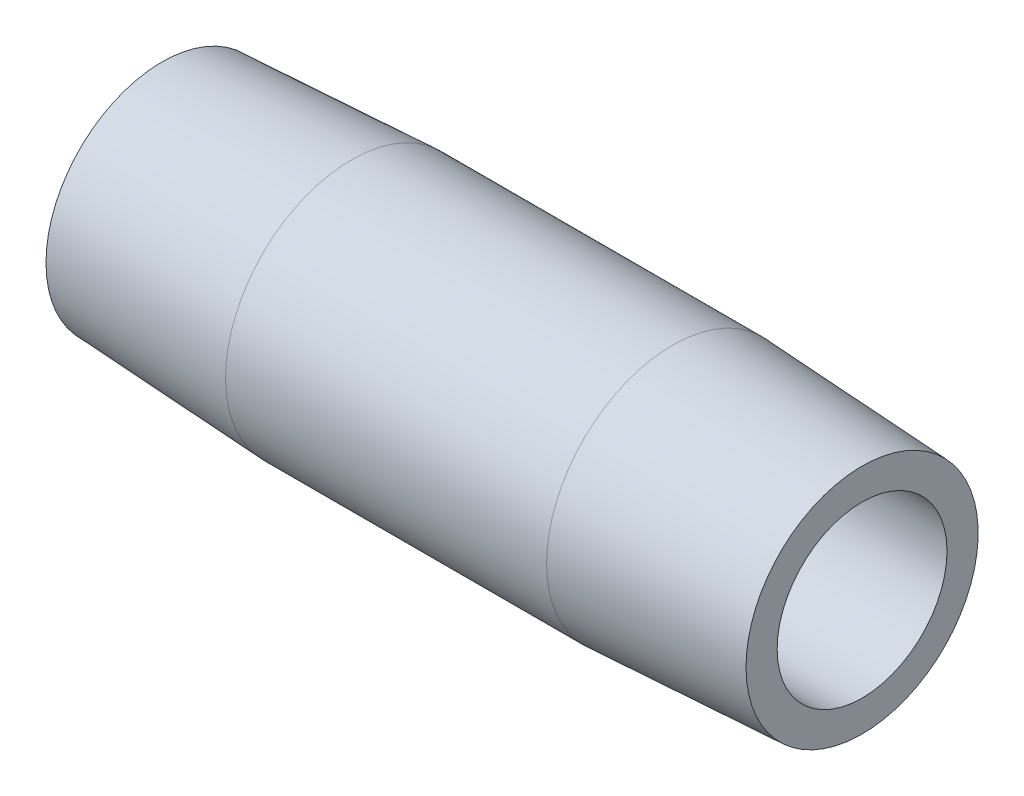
from build123d import *


with BuildPart() as part:
    # Sketch1 → Revolve1 (revolve)
    with BuildSketch(Plane(origin=(0, 0, 0), x_dir=(1, 0, 0), z_dir=(0, 1, 0)), mode=Mode.PRIVATE) as revolve1_sk:
        Polygon((38.1, 4.622776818), (0, 4.622776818), (0, 6.317526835), (10.3124, 6.857976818), (27.7876, 6.857976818), (38.1, 6.317526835), align=None)
    revolve(revolve1_sk.sketch.rotate(Axis((-6.375994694, 0, 0), (1, 0, 0)), 180), axis=Axis((-6.375994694, 0, 0), (1, 0, 0)))


solid = part.part
